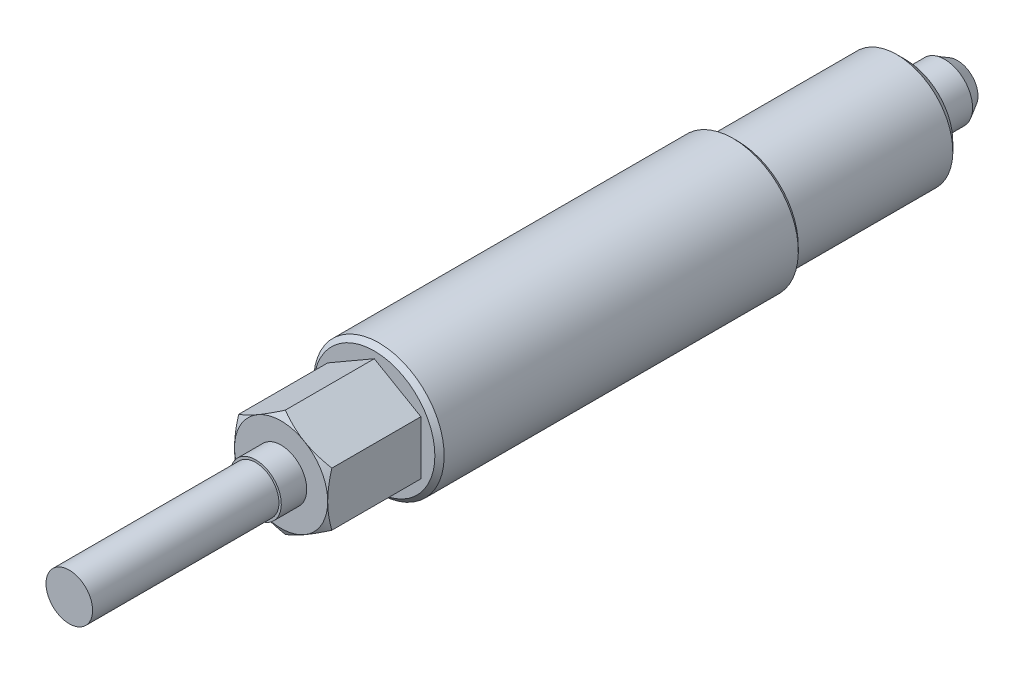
ISO-10303-21;
HEADER;
FILE_DESCRIPTION(('STEP AP214'),'2;1');
FILE_NAME('part.step','',(''),(''),'','','');
FILE_SCHEMA(('AUTOMOTIVE_DESIGN { 1 0 10303 214 1 1 1 1 }'));
ENDSEC;
DATA;
#1=APPLICATION_CONTEXT('core data for automotive mechanical design processes');
#2=APPLICATION_PROTOCOL_DEFINITION('international standard','automotive_design',2000,#1);
#3=PRODUCT_CONTEXT('',#1,'mechanical');
#4=PRODUCT('Part','Part','',(#3));
#5=PRODUCT_RELATED_PRODUCT_CATEGORY('part','',(#4));
#6=PRODUCT_DEFINITION_FORMATION('','',#4);
#7=PRODUCT_DEFINITION_CONTEXT('part definition',#1,'design');
#8=PRODUCT_DEFINITION('design','',#6,#7);
#9=PRODUCT_DEFINITION_SHAPE('','',#8);
#10=(LENGTH_UNIT() NAMED_UNIT(*) SI_UNIT(.MILLI.,.METRE.));
#11=(NAMED_UNIT(*) PLANE_ANGLE_UNIT() SI_UNIT($,.RADIAN.));
#12=(NAMED_UNIT(*) SI_UNIT($,.STERADIAN.) SOLID_ANGLE_UNIT());
#13=UNCERTAINTY_MEASURE_WITH_UNIT(LENGTH_MEASURE(1.E-05),#10,'distance_accuracy_value','');
#14=(GEOMETRIC_REPRESENTATION_CONTEXT(3) GLOBAL_UNCERTAINTY_ASSIGNED_CONTEXT((#13)) GLOBAL_UNIT_ASSIGNED_CONTEXT((#10,
#11,#12)) REPRESENTATION_CONTEXT('',''));
#15=CARTESIAN_POINT('',(0.,0.,0.));
#16=DIRECTION('',(0.,0.,1.));
#17=DIRECTION('',(1.,0.,0.));
#18=AXIS2_PLACEMENT_3D('',#15,#16,#17);
#19=CARTESIAN_POINT('',(0.,0.,57.));
#20=DIRECTION('',(0.,0.,-1.));
#21=DIRECTION('',(0.,1.,0.));
#22=AXIS2_PLACEMENT_3D('',#19,#20,#21);
#23=CONICAL_SURFACE('',#22,6.5,0.785398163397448);
#24=CARTESIAN_POINT('',(0.,0.,56.5));
#25=DIRECTION('',(0.,0.,-1.));
#26=DIRECTION('',(0.,1.,0.));
#27=AXIS2_PLACEMENT_3D('',#24,#25,#26);
#28=CIRCLE('',#27,7.);
#29=CARTESIAN_POINT('',(0.,7.,56.5));
#30=VERTEX_POINT('',#29);
#31=EDGE_CURVE('E151',#30,#30,#28,.T.);
#32=ORIENTED_EDGE('',*,*,#31,.F.);
#33=EDGE_LOOP('',(#32));
#34=FACE_BOUND('',#33,.T.);
#35=CARTESIAN_POINT('',(0.,0.,57.));
#36=DIRECTION('',(0.,0.,1.));
#37=DIRECTION('',(0.,-1.,0.));
#38=AXIS2_PLACEMENT_3D('',#35,#36,#37);
#39=CIRCLE('',#38,6.5);
#40=CARTESIAN_POINT('',(0.,-6.5,57.));
#41=VERTEX_POINT('',#40);
#42=EDGE_CURVE('E120',#41,#41,#39,.T.);
#43=ORIENTED_EDGE('',*,*,#42,.F.);
#44=EDGE_LOOP('',(#43));
#45=FACE_BOUND('',#44,.T.);
#46=ADVANCED_FACE('F14',(#34,#45),#23,.T.);
#47=CARTESIAN_POINT('',(0.,0.,0.));
#48=DIRECTION('',(0.,0.,-1.));
#49=DIRECTION('',(0.,1.,0.));
#50=AXIS2_PLACEMENT_3D('',#47,#48,#49);
#51=CYLINDRICAL_SURFACE('',#50,7.);
#52=CARTESIAN_POINT('',(0.,0.,18.5));
#53=DIRECTION('',(0.,0.,-1.));
#54=DIRECTION('',(0.,1.,0.));
#55=AXIS2_PLACEMENT_3D('',#52,#53,#54);
#56=CIRCLE('',#55,7.);
#57=CARTESIAN_POINT('',(0.,7.,18.5));
#58=VERTEX_POINT('',#57);
#59=EDGE_CURVE('E148',#58,#58,#56,.T.);
#60=ORIENTED_EDGE('',*,*,#59,.F.);
#61=EDGE_LOOP('',(#60));
#62=FACE_BOUND('',#61,.T.);
#63=ORIENTED_EDGE('',*,*,#31,.T.);
#64=EDGE_LOOP('',(#63));
#65=FACE_BOUND('',#64,.T.);
#66=ADVANCED_FACE('F218',(#62,#65),#51,.T.);
#67=CARTESIAN_POINT('',(0.,0.,18.5));
#68=DIRECTION('',(0.,0.,1.));
#69=DIRECTION('',(0.,-1.,0.));
#70=AXIS2_PLACEMENT_3D('',#67,#68,#69);
#71=CONICAL_SURFACE('',#70,7.,0.785398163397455);
#72=CARTESIAN_POINT('',(0.,0.,18.));
#73=DIRECTION('',(0.,0.,-1.));
#74=DIRECTION('',(0.,1.,0.));
#75=AXIS2_PLACEMENT_3D('',#72,#73,#74);
#76=CIRCLE('',#75,6.5);
#77=CARTESIAN_POINT('',(0.,6.5,18.));
#78=VERTEX_POINT('',#77);
#79=EDGE_CURVE('E145',#78,#78,#76,.T.);
#80=ORIENTED_EDGE('',*,*,#79,.F.);
#81=EDGE_LOOP('',(#80));
#82=FACE_BOUND('',#81,.T.);
#83=ORIENTED_EDGE('',*,*,#59,.T.);
#84=EDGE_LOOP('',(#83));
#85=FACE_BOUND('',#84,.T.);
#86=ADVANCED_FACE('F214',(#82,#85),#71,.T.);
#87=CARTESIAN_POINT('',(6.5,0.,18.));
#88=DIRECTION('',(0.,0.,1.));
#89=DIRECTION('',(0.,-1.,0.));
#90=AXIS2_PLACEMENT_3D('',#87,#88,#89);
#91=PLANE('',#90);
#92=CARTESIAN_POINT('',(0.,0.,18.));
#93=DIRECTION('',(0.,0.,-1.));
#94=DIRECTION('',(0.,1.,0.));
#95=AXIS2_PLACEMENT_3D('',#92,#93,#94);
#96=CIRCLE('',#95,6.);
#97=CARTESIAN_POINT('',(0.,6.,18.));
#98=VERTEX_POINT('',#97);
#99=EDGE_CURVE('E142',#98,#98,#96,.T.);
#100=ORIENTED_EDGE('',*,*,#99,.F.);
#101=EDGE_LOOP('',(#100));
#102=FACE_BOUND('',#101,.T.);
#103=ORIENTED_EDGE('',*,*,#79,.T.);
#104=EDGE_LOOP('',(#103));
#105=FACE_BOUND('',#104,.T.);
#106=ADVANCED_FACE('F211',(#102,#105),#91,.F.);
#107=CARTESIAN_POINT('',(-5.,2.88675134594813,57.));
#108=DIRECTION('',(-1.,0.,0.));
#109=DIRECTION('',(0.,-1.,0.));
#110=AXIS2_PLACEMENT_3D('',#107,#108,#109);
#111=PLANE('',#110);
#112=CARTESIAN_POINT('',(-5.,7.79521366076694,64.5399343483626));
#113=CARTESIAN_POINT('',(-5.,7.5764528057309,64.6462173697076));
#114=CARTESIAN_POINT('',(-5.,7.35719409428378,64.7514929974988));
#115=CARTESIAN_POINT('',(-5.,6.91741629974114,64.9594635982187));
#116=CARTESIAN_POINT('',(-5.,6.69689702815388,65.062158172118));
#117=CARTESIAN_POINT('',(-5.,6.25321722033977,65.2649085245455));
#118=CARTESIAN_POINT('',(-5.,6.03004886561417,65.3649472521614));
#119=CARTESIAN_POINT('',(-5.,5.58195110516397,65.5609843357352));
#120=CARTESIAN_POINT('',(-5.,5.35702178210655,65.6569828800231));
#121=CARTESIAN_POINT('',(-5.,4.89769068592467,65.8469148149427));
#122=CARTESIAN_POINT('',(-5.,4.66321876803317,65.9406794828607));
#123=CARTESIAN_POINT('',(-5.,4.19154711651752,66.1212112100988));
#124=CARTESIAN_POINT('',(-5.,3.95434708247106,66.2079774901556));
#125=CARTESIAN_POINT('',(-5.,3.47727241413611,66.3722652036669));
#126=CARTESIAN_POINT('',(-5.,3.23740416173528,66.4498049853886));
#127=CARTESIAN_POINT('',(-5.,2.75422725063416,66.593178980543));
#128=CARTESIAN_POINT('',(-5.,2.51091968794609,66.6590168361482));
#129=CARTESIAN_POINT('',(-5.,2.02205222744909,66.775510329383));
#130=CARTESIAN_POINT('',(-5.,1.77651220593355,66.8262478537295));
#131=CARTESIAN_POINT('',(-5.,1.2823365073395,66.9096903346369));
#132=CARTESIAN_POINT('',(-5.,1.03370114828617,66.9423971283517));
#133=CARTESIAN_POINT('',(-5.,0.537842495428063,66.9867425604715));
#134=CARTESIAN_POINT('',(-5.,0.290644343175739,66.9986553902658));
#135=CARTESIAN_POINT('',(-5.,-0.203882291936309,67.0011273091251));
#136=CARTESIAN_POINT('',(-5.,-0.451210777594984,66.9916859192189));
#137=CARTESIAN_POINT('',(-5.,-0.869833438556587,66.958305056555));
#138=CARTESIAN_POINT('',(-5.,-1.04157084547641,66.9395945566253));
#139=CARTESIAN_POINT('',(-5.,-1.38380826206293,66.8930197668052));
#140=CARTESIAN_POINT('',(-5.,-1.55430810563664,66.8651542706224));
#141=CARTESIAN_POINT('',(-5.,-2.06370854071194,66.7692878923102));
#142=CARTESIAN_POINT('',(-5.,-2.4003298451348,66.6890334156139));
#143=CARTESIAN_POINT('',(-5.,-2.9038384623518,66.5495919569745));
#144=CARTESIAN_POINT('',(-5.,-3.07332661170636,66.4992595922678));
#145=CARTESIAN_POINT('',(-5.,-3.41065642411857,66.3933023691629));
#146=CARTESIAN_POINT('',(-5.,-3.57849807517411,66.3376774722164));
#147=CARTESIAN_POINT('',(-5.,-3.91258846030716,66.2220333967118));
#148=CARTESIAN_POINT('',(-5.,-4.07883767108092,66.1620155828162));
#149=CARTESIAN_POINT('',(-5.,-4.40995264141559,66.0382984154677));
#150=CARTESIAN_POINT('',(-5.,-4.57481842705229,65.9745991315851));
#151=CARTESIAN_POINT('',(-5.,-5.00125658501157,65.8052374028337));
#152=CARTESIAN_POINT('',(-5.,-5.2618839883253,65.6971984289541));
#153=CARTESIAN_POINT('',(-5.,-5.78061537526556,65.4752037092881));
#154=CARTESIAN_POINT('',(-5.,-6.03871912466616,65.3612474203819));
#155=CARTESIAN_POINT('',(-5.,-6.55294218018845,65.1287585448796));
#156=CARTESIAN_POINT('',(-5.,-6.80906088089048,65.0102246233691));
#157=CARTESIAN_POINT('',(-5.,-7.3196320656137,64.7696140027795));
#158=CARTESIAN_POINT('',(-5.,-7.57408450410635,64.6475372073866));
#159=CARTESIAN_POINT('',(-5.,-8.08197779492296,64.4004152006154));
#160=CARTESIAN_POINT('',(-5.,-8.33541675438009,64.2753661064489));
#161=CARTESIAN_POINT('',(-5.,-8.84117201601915,64.0230156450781));
#162=CARTESIAN_POINT('',(-5.,-9.09348830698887,63.8957142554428));
#163=CARTESIAN_POINT('',(-5.,-9.84895753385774,63.5111422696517));
#164=CARTESIAN_POINT('',(-5.,-10.3507276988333,63.2511562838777));
#165=CARTESIAN_POINT('',(-5.,-11.3022827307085,62.752181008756));
#166=CARTESIAN_POINT('',(-5.,-11.7523102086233,62.5136522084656));
#167=CARTESIAN_POINT('',(-5.,-12.6508152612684,62.033639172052));
#168=CARTESIAN_POINT('',(-5.,-13.0992927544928,61.792154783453));
#169=CARTESIAN_POINT('',(-5.,-13.9936935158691,61.307716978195));
#170=CARTESIAN_POINT('',(-5.,-14.4396204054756,61.0647702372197));
#171=CARTESIAN_POINT('',(-5.,-15.3305024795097,60.5771741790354));
#172=CARTESIAN_POINT('',(-5.,-15.7754577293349,60.3325249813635));
#173=CARTESIAN_POINT('',(-5.,-16.2200666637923,60.0872519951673));
#174=B_SPLINE_CURVE_WITH_KNOTS('',3,(#112,#113,#114,#115,#116,#117,#118,#119,#120,#121,#122,
#123,#124,#125,#126,#127,#128,#129,#130,#131,#132,#133,#134,#135,#136,#137,#138,#139,#140,#141,
#142,#143,#144,#145,#146,#147,#148,#149,#150,#151,#152,#153,#154,#155,#156,#157,#158,#159,#160,
#161,#162,#163,#164,#165,#166,#167,#168,#169,#170,#171,#172,#173),.UNSPECIFIED.,.F.,.F.,(4,2,2,
2,2,2,2,2,2,2,2,2,2,2,2,2,2,2,2,2,2,2,2,2,2,2,2,2,2,2,4),(0.,0.729646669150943,1.45940545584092,
2.19306727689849,2.92669486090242,3.68418360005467,4.44175656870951,5.19779687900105,
5.95360146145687,6.70522945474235,7.45678085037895,8.19834515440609,8.93992609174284,
9.45793663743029,9.97601546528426,11.0127134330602,11.5430787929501,12.0734480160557,
12.6036531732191,13.1338483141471,13.9801413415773,14.8265121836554,15.6731317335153,
16.5197743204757,17.3675913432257,18.2154168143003,19.9107440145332,21.4387334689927,
22.9668020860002,24.4902367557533,26.0135655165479),.UNSPECIFIED.);
#175=CARTESIAN_POINT('',(-5.,-2.88675134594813,66.5534180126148));
#176=VERTEX_POINT('',#175);
#177=CARTESIAN_POINT('',(-5.,0.,67.));
#178=VERTEX_POINT('',#177);
#179=EDGE_CURVE('E9',#176,#178,#174,.F.);
#180=ORIENTED_EDGE('',*,*,#179,.T.);
#181=CARTESIAN_POINT('',(-5.,2.88675134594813,66.5534180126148));
#182=VERTEX_POINT('',#181);
#183=EDGE_CURVE('E18',#178,#182,#174,.F.);
#184=ORIENTED_EDGE('',*,*,#183,.T.);
#185=DIRECTION('',(0.,0.,1.));
#186=VECTOR('',#185,1.);
#187=CARTESIAN_POINT('',(-5.,2.88675134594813,57.));
#188=LINE('',#187,#186);
#189=CARTESIAN_POINT('',(-5.,2.88675134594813,57.));
#190=VERTEX_POINT('',#189);
#191=EDGE_CURVE('E111',#190,#182,#188,.T.);
#192=ORIENTED_EDGE('',*,*,#191,.F.);
#193=DIRECTION('',(0.,-1.,0.));
#194=VECTOR('',#193,1.);
#195=CARTESIAN_POINT('',(-5.,2.88675134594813,57.));
#196=LINE('',#195,#194);
#197=CARTESIAN_POINT('',(-5.,-2.88675134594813,57.));
#198=VERTEX_POINT('',#197);
#199=EDGE_CURVE('E97',#190,#198,#196,.T.);
#200=ORIENTED_EDGE('',*,*,#199,.T.);
#201=DIRECTION('',(0.,0.,1.));
#202=VECTOR('',#201,1.);
#203=CARTESIAN_POINT('',(-5.,-2.88675134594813,57.));
#204=LINE('',#203,#202);
#205=EDGE_CURVE('E89',#198,#176,#204,.T.);
#206=ORIENTED_EDGE('',*,*,#205,.T.);
#207=EDGE_LOOP('',(#180,#184,#192,#200,#206));
#208=FACE_BOUND('',#207,.T.);
#209=ADVANCED_FACE('F110',(#208),#111,.T.);
#210=CARTESIAN_POINT('',(0.,5.77350269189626,57.));
#211=DIRECTION('',(-0.5,0.866025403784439,0.));
#212=DIRECTION('',(-0.866025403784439,-0.5,0.));
#213=AXIS2_PLACEMENT_3D('',#210,#211,#212);
#214=PLANE('',#213);
#215=CARTESIAN_POINT('',(-5.0002,2.88663587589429,66.5533513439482));
#216=CARTESIAN_POINT('',(-4.78046540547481,3.01349970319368,66.6266134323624));
#217=CARTESIAN_POINT('',(-4.55885141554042,3.14144859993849,66.6932486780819));
#218=CARTESIAN_POINT('',(-4.11178600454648,3.39956193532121,66.8095610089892));
#219=CARTESIAN_POINT('',(-3.88632664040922,3.52973095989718,66.8591969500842));
#220=CARTESIAN_POINT('',(-3.43816769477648,3.78847564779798,66.9364489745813));
#221=CARTESIAN_POINT('',(-3.2155379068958,3.91701101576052,66.9645796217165));
#222=CARTESIAN_POINT('',(-2.88081009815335,4.11026620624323,66.9898050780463));
#223=CARTESIAN_POINT('',(-2.76915780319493,4.17472868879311,66.9953865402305));
#224=CARTESIAN_POINT('',(-2.5457500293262,4.30371322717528,67.0007977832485));
#225=CARTESIAN_POINT('',(-2.43399455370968,4.36823528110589,67.0006277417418));
#226=CARTESIAN_POINT('',(-2.12781576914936,4.54500768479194,66.992246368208));
#227=CARTESIAN_POINT('',(-1.93349391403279,4.65719946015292,66.9781702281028));
#228=CARTESIAN_POINT('',(-1.5461398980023,4.88083840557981,66.9335347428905));
#229=CARTESIAN_POINT('',(-1.35310909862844,4.9922847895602,66.9029601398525));
#230=CARTESIAN_POINT('',(-0.964974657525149,5.21637431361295,66.8265315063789));
#231=CARTESIAN_POINT('',(-0.769920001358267,5.32898917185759,66.7803536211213));
#232=CARTESIAN_POINT('',(-0.382719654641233,5.55253939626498,66.6755482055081));
#233=CARTESIAN_POINT('',(-0.190569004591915,5.66347762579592,66.6169452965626));
#234=CARTESIAN_POINT('',(0.000200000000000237,5.7736181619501,66.5533513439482));
#235=B_SPLINE_CURVE_WITH_KNOTS('',3,(#215,#216,#217,#218,#219,#220,#221,#222,#223,#224,#225,
#226,#227,#228,#229,#230,#231,#232,#233,#234),.UNSPECIFIED.,.F.,.F.,(4,2,2,2,2,2,2,2,2,4),(0.,
0.792555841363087,1.58701660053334,2.36181537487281,2.74884076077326,3.13585419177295,
3.80962362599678,4.48401723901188,5.17336882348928,5.86136694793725),.UNSPECIFIED.);
#236=CARTESIAN_POINT('',(-2.5,4.3301270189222,67.));
#237=VERTEX_POINT('',#236);
#238=EDGE_CURVE('E255',#182,#237,#235,.T.);
#239=ORIENTED_EDGE('',*,*,#238,.T.);
#240=CARTESIAN_POINT('',(0.,5.77350269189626,66.5534180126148));
#241=VERTEX_POINT('',#240);
#242=EDGE_CURVE('E249',#237,#241,#235,.T.);
#243=ORIENTED_EDGE('',*,*,#242,.T.);
#244=DIRECTION('',(0.,0.,1.));
#245=VECTOR('',#244,1.);
#246=CARTESIAN_POINT('',(0.,5.77350269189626,57.));
#247=LINE('',#246,#245);
#248=CARTESIAN_POINT('',(0.,5.77350269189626,57.));
#249=VERTEX_POINT('',#248);
#250=EDGE_CURVE('E121',#249,#241,#247,.T.);
#251=ORIENTED_EDGE('',*,*,#250,.F.);
#252=DIRECTION('',(-0.866025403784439,-0.5,0.));
#253=VECTOR('',#252,1.);
#254=CARTESIAN_POINT('',(0.,5.77350269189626,57.));
#255=LINE('',#254,#253);
#256=EDGE_CURVE('E113',#249,#190,#255,.T.);
#257=ORIENTED_EDGE('',*,*,#256,.T.);
#258=ORIENTED_EDGE('',*,*,#191,.T.);
#259=EDGE_LOOP('',(#239,#243,#251,#257,#258));
#260=FACE_BOUND('',#259,.T.);
#261=ADVANCED_FACE('F242',(#260),#214,.T.);
#262=CARTESIAN_POINT('',(5.,2.88675134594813,57.));
#263=DIRECTION('',(0.5,0.866025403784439,0.));
#264=DIRECTION('',(-0.866025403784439,0.5,0.));
#265=AXIS2_PLACEMENT_3D('',#262,#263,#264);
#266=PLANE('',#265);
#267=CARTESIAN_POINT('',(-0.0002,5.77361816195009,66.5533513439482));
#268=CARTESIAN_POINT('',(0.219534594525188,5.6467543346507,66.6266134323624));
#269=CARTESIAN_POINT('',(0.441148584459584,5.51880543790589,66.6932486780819));
#270=CARTESIAN_POINT('',(0.888213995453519,5.26069210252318,66.8095610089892));
#271=CARTESIAN_POINT('',(1.11367335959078,5.13052307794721,66.8591969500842));
#272=CARTESIAN_POINT('',(1.56183230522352,4.87177839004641,66.9364489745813));
#273=CARTESIAN_POINT('',(1.7844620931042,4.74324302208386,66.9645796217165));
#274=CARTESIAN_POINT('',(2.11918990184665,4.54998783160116,66.9898050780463));
#275=CARTESIAN_POINT('',(2.23084219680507,4.48552534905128,66.9953865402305));
#276=CARTESIAN_POINT('',(2.4542499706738,4.35654081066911,67.0007977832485));
#277=CARTESIAN_POINT('',(2.56600544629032,4.2920187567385,67.0006277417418));
#278=CARTESIAN_POINT('',(2.87218423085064,4.11524635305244,66.992246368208));
#279=CARTESIAN_POINT('',(3.06650608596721,4.00305457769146,66.9781702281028));
#280=CARTESIAN_POINT('',(3.4538601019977,3.77941563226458,66.9335347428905));
#281=CARTESIAN_POINT('',(3.64689090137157,3.66796924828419,66.9029601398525));
#282=CARTESIAN_POINT('',(4.03502534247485,3.44387972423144,66.8265315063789));
#283=CARTESIAN_POINT('',(4.23007999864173,3.3312648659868,66.7803536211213));
#284=CARTESIAN_POINT('',(4.61728034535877,3.10771464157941,66.6755482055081));
#285=CARTESIAN_POINT('',(4.80943099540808,2.99677641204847,66.6169452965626));
#286=CARTESIAN_POINT('',(5.0002,2.88663587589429,66.5533513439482));
#287=B_SPLINE_CURVE_WITH_KNOTS('',3,(#267,#268,#269,#270,#271,#272,#273,#274,#275,#276,#277,
#278,#279,#280,#281,#282,#283,#284,#285,#286),.UNSPECIFIED.,.F.,.F.,(4,2,2,2,2,2,2,2,2,4),(0.,
0.792555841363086,1.58701660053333,2.3618153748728,2.74884076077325,3.13585419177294,
3.80962362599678,4.48401723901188,5.17336882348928,5.86136694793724),.UNSPECIFIED.);
#288=CARTESIAN_POINT('',(2.5,4.3301270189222,67.));
#289=VERTEX_POINT('',#288);
#290=EDGE_CURVE('E256',#241,#289,#287,.T.);
#291=ORIENTED_EDGE('',*,*,#290,.T.);
#292=CARTESIAN_POINT('',(5.,2.88675134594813,66.5534180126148));
#293=VERTEX_POINT('',#292);
#294=EDGE_CURVE('E257',#289,#293,#287,.T.);
#295=ORIENTED_EDGE('',*,*,#294,.T.);
#296=DIRECTION('',(0.,0.,1.));
#297=VECTOR('',#296,1.);
#298=CARTESIAN_POINT('',(5.,2.88675134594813,57.));
#299=LINE('',#298,#297);
#300=CARTESIAN_POINT('',(5.,2.88675134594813,57.));
#301=VERTEX_POINT('',#300);
#302=EDGE_CURVE('E124',#301,#293,#299,.T.);
#303=ORIENTED_EDGE('',*,*,#302,.F.);
#304=DIRECTION('',(-0.866025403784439,0.5,0.));
#305=VECTOR('',#304,1.);
#306=CARTESIAN_POINT('',(5.,2.88675134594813,57.));
#307=LINE('',#306,#305);
#308=EDGE_CURVE('E115',#301,#249,#307,.T.);
#309=ORIENTED_EDGE('',*,*,#308,.T.);
#310=ORIENTED_EDGE('',*,*,#250,.T.);
#311=EDGE_LOOP('',(#291,#295,#303,#309,#310));
#312=FACE_BOUND('',#311,.T.);
#313=ADVANCED_FACE('F246',(#312),#266,.T.);
#314=CARTESIAN_POINT('',(5.,-2.88675134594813,57.));
#315=DIRECTION('',(1.,0.,0.));
#316=DIRECTION('',(0.,1.,0.));
#317=AXIS2_PLACEMENT_3D('',#314,#315,#316);
#318=PLANE('',#317);
#319=CARTESIAN_POINT('',(5.,7.79521366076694,64.5399343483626));
#320=CARTESIAN_POINT('',(5.,7.5764528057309,64.6462173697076));
#321=CARTESIAN_POINT('',(5.,7.35719409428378,64.7514929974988));
#322=CARTESIAN_POINT('',(5.,6.91741629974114,64.9594635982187));
#323=CARTESIAN_POINT('',(5.,6.69689702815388,65.062158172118));
#324=CARTESIAN_POINT('',(5.,6.25321722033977,65.2649085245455));
#325=CARTESIAN_POINT('',(5.,6.03004886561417,65.3649472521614));
#326=CARTESIAN_POINT('',(5.,5.58195110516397,65.5609843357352));
#327=CARTESIAN_POINT('',(5.,5.35702178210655,65.6569828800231));
#328=CARTESIAN_POINT('',(5.,4.89769068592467,65.8469148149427));
#329=CARTESIAN_POINT('',(5.,4.66321876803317,65.9406794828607));
#330=CARTESIAN_POINT('',(5.,4.19154711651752,66.1212112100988));
#331=CARTESIAN_POINT('',(5.,3.95434708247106,66.2079774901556));
#332=CARTESIAN_POINT('',(5.,3.47727241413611,66.3722652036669));
#333=CARTESIAN_POINT('',(5.,3.23740416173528,66.4498049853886));
#334=CARTESIAN_POINT('',(5.,2.75422725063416,66.593178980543));
#335=CARTESIAN_POINT('',(5.,2.51091968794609,66.6590168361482));
#336=CARTESIAN_POINT('',(5.,2.02205222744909,66.775510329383));
#337=CARTESIAN_POINT('',(5.,1.77651220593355,66.8262478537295));
#338=CARTESIAN_POINT('',(5.,1.2823365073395,66.9096903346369));
#339=CARTESIAN_POINT('',(5.,1.03370114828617,66.9423971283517));
#340=CARTESIAN_POINT('',(5.,0.537842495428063,66.9867425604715));
#341=CARTESIAN_POINT('',(5.,0.290644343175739,66.9986553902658));
#342=CARTESIAN_POINT('',(5.,-0.203882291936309,67.0011273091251));
#343=CARTESIAN_POINT('',(5.,-0.451210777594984,66.9916859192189));
#344=CARTESIAN_POINT('',(5.,-0.869833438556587,66.958305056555));
#345=CARTESIAN_POINT('',(5.,-1.04157084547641,66.9395945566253));
#346=CARTESIAN_POINT('',(5.,-1.38380826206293,66.8930197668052));
#347=CARTESIAN_POINT('',(5.,-1.55430810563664,66.8651542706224));
#348=CARTESIAN_POINT('',(5.,-2.06370854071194,66.7692878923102));
#349=CARTESIAN_POINT('',(5.,-2.4003298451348,66.6890334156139));
#350=CARTESIAN_POINT('',(5.,-2.9038384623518,66.5495919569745));
#351=CARTESIAN_POINT('',(5.,-3.07332661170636,66.4992595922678));
#352=CARTESIAN_POINT('',(5.,-3.41065642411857,66.3933023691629));
#353=CARTESIAN_POINT('',(5.,-3.57849807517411,66.3376774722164));
#354=CARTESIAN_POINT('',(5.,-3.91258846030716,66.2220333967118));
#355=CARTESIAN_POINT('',(5.,-4.07883767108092,66.1620155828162));
#356=CARTESIAN_POINT('',(5.,-4.40995264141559,66.0382984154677));
#357=CARTESIAN_POINT('',(5.,-4.57481842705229,65.9745991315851));
#358=CARTESIAN_POINT('',(5.,-5.00125658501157,65.8052374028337));
#359=CARTESIAN_POINT('',(5.,-5.2618839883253,65.6971984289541));
#360=CARTESIAN_POINT('',(5.,-5.78061537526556,65.4752037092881));
#361=CARTESIAN_POINT('',(5.,-6.03871912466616,65.3612474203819));
#362=CARTESIAN_POINT('',(5.,-6.55294218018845,65.1287585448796));
#363=CARTESIAN_POINT('',(5.,-6.80906088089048,65.0102246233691));
#364=CARTESIAN_POINT('',(5.,-7.3196320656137,64.7696140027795));
#365=CARTESIAN_POINT('',(5.,-7.57408450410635,64.6475372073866));
#366=CARTESIAN_POINT('',(5.,-8.08197779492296,64.4004152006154));
#367=CARTESIAN_POINT('',(5.,-8.33541675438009,64.2753661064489));
#368=CARTESIAN_POINT('',(5.,-8.84117201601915,64.0230156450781));
#369=CARTESIAN_POINT('',(5.,-9.09348830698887,63.8957142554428));
#370=CARTESIAN_POINT('',(5.,-9.84895753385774,63.5111422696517));
#371=CARTESIAN_POINT('',(5.,-10.3507276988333,63.2511562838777));
#372=CARTESIAN_POINT('',(5.,-11.3022827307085,62.752181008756));
#373=CARTESIAN_POINT('',(5.,-11.7523102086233,62.5136522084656));
#374=CARTESIAN_POINT('',(5.,-12.6508152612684,62.033639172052));
#375=CARTESIAN_POINT('',(5.,-13.0992927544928,61.792154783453));
#376=CARTESIAN_POINT('',(5.,-13.9936935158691,61.307716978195));
#377=CARTESIAN_POINT('',(5.,-14.4396204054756,61.0647702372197));
#378=CARTESIAN_POINT('',(5.,-15.3305024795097,60.5771741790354));
#379=CARTESIAN_POINT('',(5.,-15.7754577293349,60.3325249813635));
#380=CARTESIAN_POINT('',(5.,-16.2200666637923,60.0872519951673));
#381=B_SPLINE_CURVE_WITH_KNOTS('',3,(#319,#320,#321,#322,#323,#324,#325,#326,#327,#328,#329,
#330,#331,#332,#333,#334,#335,#336,#337,#338,#339,#340,#341,#342,#343,#344,#345,#346,#347,#348,
#349,#350,#351,#352,#353,#354,#355,#356,#357,#358,#359,#360,#361,#362,#363,#364,#365,#366,#367,
#368,#369,#370,#371,#372,#373,#374,#375,#376,#377,#378,#379,#380),.UNSPECIFIED.,.F.,.F.,(4,2,2,
2,2,2,2,2,2,2,2,2,2,2,2,2,2,2,2,2,2,2,2,2,2,2,2,2,2,2,4),(0.,0.729646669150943,1.45940545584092,
2.19306727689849,2.92669486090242,3.68418360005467,4.44175656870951,5.19779687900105,
5.95360146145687,6.70522945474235,7.45678085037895,8.19834515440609,8.93992609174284,
9.45793663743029,9.97601546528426,11.0127134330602,11.5430787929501,12.0734480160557,
12.6036531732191,13.1338483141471,13.9801413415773,14.8265121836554,15.6731317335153,
16.5197743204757,17.3675913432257,18.2154168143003,19.9107440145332,21.4387334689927,
22.9668020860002,24.4902367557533,26.0135655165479),.UNSPECIFIED.);
#382=CARTESIAN_POINT('',(5.,0.,67.));
#383=VERTEX_POINT('',#382);
#384=EDGE_CURVE('E262',#293,#383,#381,.T.);
#385=ORIENTED_EDGE('',*,*,#384,.T.);
#386=CARTESIAN_POINT('',(5.,-2.88675134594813,66.5534180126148));
#387=VERTEX_POINT('',#386);
#388=EDGE_CURVE('E263',#383,#387,#381,.T.);
#389=ORIENTED_EDGE('',*,*,#388,.T.);
#390=DIRECTION('',(0.,0.,1.));
#391=VECTOR('',#390,1.);
#392=CARTESIAN_POINT('',(5.,-2.88675134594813,57.));
#393=LINE('',#392,#391);
#394=CARTESIAN_POINT('',(5.,-2.88675134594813,57.));
#395=VERTEX_POINT('',#394);
#396=EDGE_CURVE('E127',#395,#387,#393,.T.);
#397=ORIENTED_EDGE('',*,*,#396,.F.);
#398=DIRECTION('',(0.,1.,0.));
#399=VECTOR('',#398,1.);
#400=CARTESIAN_POINT('',(5.,-2.88675134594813,57.));
#401=LINE('',#400,#399);
#402=EDGE_CURVE('E316',#395,#301,#401,.T.);
#403=ORIENTED_EDGE('',*,*,#402,.T.);
#404=ORIENTED_EDGE('',*,*,#302,.T.);
#405=EDGE_LOOP('',(#385,#389,#397,#403,#404));
#406=FACE_BOUND('',#405,.T.);
#407=ADVANCED_FACE('F269',(#406),#318,.T.);
#408=CARTESIAN_POINT('',(0.,-5.77350269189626,57.));
#409=DIRECTION('',(0.5,-0.866025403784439,0.));
#410=DIRECTION('',(0.866025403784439,0.5,0.));
#411=AXIS2_PLACEMENT_3D('',#408,#409,#410);
#412=PLANE('',#411);
#413=CARTESIAN_POINT('',(5.0002,-2.88663587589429,66.5533513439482));
#414=CARTESIAN_POINT('',(4.78046540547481,-3.01349970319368,66.6266134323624));
#415=CARTESIAN_POINT('',(4.55885141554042,-3.14144859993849,66.6932486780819));
#416=CARTESIAN_POINT('',(4.11178600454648,-3.39956193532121,66.8095610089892));
#417=CARTESIAN_POINT('',(3.88632664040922,-3.52973095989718,66.8591969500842));
#418=CARTESIAN_POINT('',(3.43816769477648,-3.78847564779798,66.9364489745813));
#419=CARTESIAN_POINT('',(3.2155379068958,-3.91701101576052,66.9645796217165));
#420=CARTESIAN_POINT('',(2.88081009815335,-4.11026620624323,66.9898050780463));
#421=CARTESIAN_POINT('',(2.76915780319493,-4.17472868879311,66.9953865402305));
#422=CARTESIAN_POINT('',(2.5457500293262,-4.30371322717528,67.0007977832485));
#423=CARTESIAN_POINT('',(2.43399455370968,-4.36823528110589,67.0006277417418));
#424=CARTESIAN_POINT('',(2.12781576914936,-4.54500768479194,66.992246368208));
#425=CARTESIAN_POINT('',(1.93349391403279,-4.65719946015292,66.9781702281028));
#426=CARTESIAN_POINT('',(1.5461398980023,-4.88083840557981,66.9335347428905));
#427=CARTESIAN_POINT('',(1.35310909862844,-4.9922847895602,66.9029601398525));
#428=CARTESIAN_POINT('',(0.964974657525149,-5.21637431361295,66.8265315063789));
#429=CARTESIAN_POINT('',(0.769920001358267,-5.32898917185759,66.7803536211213));
#430=CARTESIAN_POINT('',(0.382719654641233,-5.55253939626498,66.6755482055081));
#431=CARTESIAN_POINT('',(0.190569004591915,-5.66347762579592,66.6169452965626));
#432=CARTESIAN_POINT('',(-0.000200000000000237,-5.7736181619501,66.5533513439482));
#433=B_SPLINE_CURVE_WITH_KNOTS('',3,(#413,#414,#415,#416,#417,#418,#419,#420,#421,#422,#423,
#424,#425,#426,#427,#428,#429,#430,#431,#432),.UNSPECIFIED.,.F.,.F.,(4,2,2,2,2,2,2,2,2,4),(0.,
0.792555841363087,1.58701660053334,2.36181537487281,2.74884076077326,3.13585419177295,
3.80962362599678,4.48401723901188,5.17336882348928,5.86136694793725),.UNSPECIFIED.);
#434=CARTESIAN_POINT('',(2.5,-4.3301270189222,67.));
#435=VERTEX_POINT('',#434);
#436=EDGE_CURVE('E268',#387,#435,#433,.T.);
#437=ORIENTED_EDGE('',*,*,#436,.T.);
#438=CARTESIAN_POINT('',(0.,-5.77350269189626,66.5534180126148));
#439=VERTEX_POINT('',#438);
#440=EDGE_CURVE('E177',#435,#439,#433,.T.);
#441=ORIENTED_EDGE('',*,*,#440,.T.);
#442=DIRECTION('',(0.,0.,1.));
#443=VECTOR('',#442,1.);
#444=CARTESIAN_POINT('',(0.,-5.77350269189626,57.));
#445=LINE('',#444,#443);
#446=CARTESIAN_POINT('',(0.,-5.77350269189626,57.));
#447=VERTEX_POINT('',#446);
#448=EDGE_CURVE('E96',#447,#439,#445,.T.);
#449=ORIENTED_EDGE('',*,*,#448,.F.);
#450=DIRECTION('',(0.866025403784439,0.5,0.));
#451=VECTOR('',#450,1.);
#452=CARTESIAN_POINT('',(0.,-5.77350269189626,57.));
#453=LINE('',#452,#451);
#454=EDGE_CURVE('E107',#447,#395,#453,.T.);
#455=ORIENTED_EDGE('',*,*,#454,.T.);
#456=ORIENTED_EDGE('',*,*,#396,.T.);
#457=EDGE_LOOP('',(#437,#441,#449,#455,#456));
#458=FACE_BOUND('',#457,.T.);
#459=ADVANCED_FACE('F191',(#458),#412,.T.);
#460=CARTESIAN_POINT('',(-5.,-2.88675134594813,57.));
#461=DIRECTION('',(-0.5,-0.866025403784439,0.));
#462=DIRECTION('',(0.866025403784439,-0.5,0.));
#463=AXIS2_PLACEMENT_3D('',#460,#461,#462);
#464=PLANE('',#463);
#465=CARTESIAN_POINT('',(0.0002,-5.77361816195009,66.5533513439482));
#466=CARTESIAN_POINT('',(-0.219534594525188,-5.6467543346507,66.6266134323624));
#467=CARTESIAN_POINT('',(-0.441148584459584,-5.51880543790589,66.6932486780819));
#468=CARTESIAN_POINT('',(-0.888213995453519,-5.26069210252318,66.8095610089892));
#469=CARTESIAN_POINT('',(-1.11367335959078,-5.13052307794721,66.8591969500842));
#470=CARTESIAN_POINT('',(-1.56183230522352,-4.87177839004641,66.9364489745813));
#471=CARTESIAN_POINT('',(-1.7844620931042,-4.74324302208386,66.9645796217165));
#472=CARTESIAN_POINT('',(-2.11918990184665,-4.54998783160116,66.9898050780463));
#473=CARTESIAN_POINT('',(-2.23084219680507,-4.48552534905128,66.9953865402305));
#474=CARTESIAN_POINT('',(-2.4542499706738,-4.35654081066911,67.0007977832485));
#475=CARTESIAN_POINT('',(-2.56600544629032,-4.2920187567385,67.0006277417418));
#476=CARTESIAN_POINT('',(-2.87218423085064,-4.11524635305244,66.992246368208));
#477=CARTESIAN_POINT('',(-3.06650608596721,-4.00305457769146,66.9781702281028));
#478=CARTESIAN_POINT('',(-3.4538601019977,-3.77941563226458,66.9335347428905));
#479=CARTESIAN_POINT('',(-3.64689090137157,-3.66796924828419,66.9029601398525));
#480=CARTESIAN_POINT('',(-4.03502534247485,-3.44387972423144,66.8265315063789));
#481=CARTESIAN_POINT('',(-4.23007999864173,-3.3312648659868,66.7803536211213));
#482=CARTESIAN_POINT('',(-4.61728034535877,-3.10771464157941,66.6755482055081));
#483=CARTESIAN_POINT('',(-4.80943099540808,-2.99677641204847,66.6169452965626));
#484=CARTESIAN_POINT('',(-5.0002,-2.88663587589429,66.5533513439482));
#485=B_SPLINE_CURVE_WITH_KNOTS('',3,(#465,#466,#467,#468,#469,#470,#471,#472,#473,#474,#475,
#476,#477,#478,#479,#480,#481,#482,#483,#484),.UNSPECIFIED.,.F.,.F.,(4,2,2,2,2,2,2,2,2,4),(0.,
0.792555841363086,1.58701660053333,2.3618153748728,2.74884076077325,3.13585419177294,
3.80962362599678,4.48401723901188,5.17336882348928,5.86136694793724),.UNSPECIFIED.);
#486=CARTESIAN_POINT('',(-2.5,-4.3301270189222,67.));
#487=VERTEX_POINT('',#486);
#488=EDGE_CURVE('E35',#439,#487,#485,.T.);
#489=ORIENTED_EDGE('',*,*,#488,.T.);
#490=EDGE_CURVE('E93',#487,#176,#485,.T.);
#491=ORIENTED_EDGE('',*,*,#490,.T.);
#492=ORIENTED_EDGE('',*,*,#205,.F.);
#493=DIRECTION('',(0.866025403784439,-0.5,0.));
#494=VECTOR('',#493,1.);
#495=CARTESIAN_POINT('',(-5.,-2.88675134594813,57.));
#496=LINE('',#495,#494);
#497=EDGE_CURVE('E92',#198,#447,#496,.T.);
#498=ORIENTED_EDGE('',*,*,#497,.T.);
#499=ORIENTED_EDGE('',*,*,#448,.T.);
#500=EDGE_LOOP('',(#489,#491,#492,#498,#499));
#501=FACE_BOUND('',#500,.T.);
#502=ADVANCED_FACE('F91',(#501),#464,.T.);
#503=CARTESIAN_POINT('',(0.,0.,57.));
#504=DIRECTION('',(0.,0.,1.));
#505=DIRECTION('',(0.,-1.,0.));
#506=AXIS2_PLACEMENT_3D('',#503,#504,#505);
#507=PLANE('',#506);
#508=ORIENTED_EDGE('',*,*,#199,.F.);
#509=ORIENTED_EDGE('',*,*,#256,.F.);
#510=ORIENTED_EDGE('',*,*,#308,.F.);
#511=ORIENTED_EDGE('',*,*,#402,.F.);
#512=ORIENTED_EDGE('',*,*,#454,.F.);
#513=ORIENTED_EDGE('',*,*,#497,.F.);
#514=EDGE_LOOP('',(#508,#509,#510,#511,#512,#513));
#515=FACE_BOUND('',#514,.T.);
#516=ORIENTED_EDGE('',*,*,#42,.T.);
#517=EDGE_LOOP('',(#516));
#518=FACE_BOUND('',#517,.T.);
#519=ADVANCED_FACE('F102',(#515,#518),#507,.T.);
#520=CARTESIAN_POINT('',(0.,0.,89.73));
#521=DIRECTION('',(0.,0.,-1.));
#522=DIRECTION('',(0.,1.,0.));
#523=AXIS2_PLACEMENT_3D('',#520,#521,#522);
#524=PLANE('',#523);
#525=CARTESIAN_POINT('',(0.,0.,89.73));
#526=DIRECTION('',(0.,0.,-1.));
#527=DIRECTION('',(0.,1.,0.));
#528=AXIS2_PLACEMENT_3D('',#525,#526,#527);
#529=CIRCLE('',#528,2.5);
#530=CARTESIAN_POINT('',(0.,2.5,89.73));
#531=VERTEX_POINT('',#530);
#532=EDGE_CURVE('E168',#531,#531,#529,.T.);
#533=ORIENTED_EDGE('',*,*,#532,.F.);
#534=EDGE_LOOP('',(#533));
#535=FACE_BOUND('',#534,.T.);
#536=ADVANCED_FACE('F16',(#535),#524,.F.);
#537=CARTESIAN_POINT('',(0.,0.,0.));
#538=DIRECTION('',(0.,0.,-1.));
#539=DIRECTION('',(0.,1.,0.));
#540=AXIS2_PLACEMENT_3D('',#537,#538,#539);
#541=CYLINDRICAL_SURFACE('',#540,2.5);
#542=CARTESIAN_POINT('',(0.,0.,69.73));
#543=DIRECTION('',(0.,0.,-1.));
#544=DIRECTION('',(0.,1.,0.));
#545=AXIS2_PLACEMENT_3D('',#542,#543,#544);
#546=CIRCLE('',#545,2.5);
#547=CARTESIAN_POINT('',(0.,2.5,69.73));
#548=VERTEX_POINT('',#547);
#549=EDGE_CURVE('E165',#548,#548,#546,.T.);
#550=ORIENTED_EDGE('',*,*,#549,.F.);
#551=EDGE_LOOP('',(#550));
#552=FACE_BOUND('',#551,.T.);
#553=ORIENTED_EDGE('',*,*,#532,.T.);
#554=EDGE_LOOP('',(#553));
#555=FACE_BOUND('',#554,.T.);
#556=ADVANCED_FACE('F235',(#552,#555),#541,.T.);
#557=CARTESIAN_POINT('',(2.5,0.,69.73));
#558=DIRECTION('',(0.,0.,-1.));
#559=DIRECTION('',(0.,1.,0.));
#560=AXIS2_PLACEMENT_3D('',#557,#558,#559);
#561=PLANE('',#560);
#562=CARTESIAN_POINT('',(0.,0.,69.73));
#563=DIRECTION('',(0.,0.,-1.));
#564=DIRECTION('',(0.,1.,0.));
#565=AXIS2_PLACEMENT_3D('',#562,#563,#564);
#566=CIRCLE('',#565,2.75);
#567=CARTESIAN_POINT('',(0.,2.75,69.73));
#568=VERTEX_POINT('',#567);
#569=EDGE_CURVE('E162',#568,#568,#566,.T.);
#570=ORIENTED_EDGE('',*,*,#569,.F.);
#571=EDGE_LOOP('',(#570));
#572=FACE_BOUND('',#571,.T.);
#573=ORIENTED_EDGE('',*,*,#549,.T.);
#574=EDGE_LOOP('',(#573));
#575=FACE_BOUND('',#574,.T.);
#576=ADVANCED_FACE('F574',(#572,#575),#561,.F.);
#577=CARTESIAN_POINT('',(0.,0.,0.));
#578=DIRECTION('',(0.,0.,-1.));
#579=DIRECTION('',(0.,1.,0.));
#580=AXIS2_PLACEMENT_3D('',#577,#578,#579);
#581=CYLINDRICAL_SURFACE('',#580,2.75);
#582=CARTESIAN_POINT('',(0.,0.,67.));
#583=DIRECTION('',(0.,0.,-1.));
#584=DIRECTION('',(0.,1.,0.));
#585=AXIS2_PLACEMENT_3D('',#582,#583,#584);
#586=CIRCLE('',#585,2.75);
#587=CARTESIAN_POINT('',(0.,2.75,67.));
#588=VERTEX_POINT('',#587);
#589=EDGE_CURVE('E158',#588,#588,#586,.T.);
#590=ORIENTED_EDGE('',*,*,#589,.F.);
#591=EDGE_LOOP('',(#590));
#592=FACE_BOUND('',#591,.T.);
#593=ORIENTED_EDGE('',*,*,#569,.T.);
#594=EDGE_LOOP('',(#593));
#595=FACE_BOUND('',#594,.T.);
#596=ADVANCED_FACE('F567',(#592,#595),#581,.T.);
#597=CARTESIAN_POINT('',(0.,0.,67.));
#598=DIRECTION('',(0.,0.,-1.));
#599=DIRECTION('',(0.,1.,0.));
#600=AXIS2_PLACEMENT_3D('',#597,#598,#599);
#601=CONICAL_SURFACE('',#600,5.,1.0471975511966);
#602=ORIENTED_EDGE('',*,*,#388,.F.);
#603=CARTESIAN_POINT('',(0.,0.,67.));
#604=DIRECTION('',(0.,0.,-1.));
#605=DIRECTION('',(0.,1.,0.));
#606=AXIS2_PLACEMENT_3D('',#603,#604,#605);
#607=CIRCLE('',#606,5.);
#608=EDGE_CURVE('E155',#383,#435,#607,.T.);
#609=ORIENTED_EDGE('',*,*,#608,.T.);
#610=ORIENTED_EDGE('',*,*,#436,.F.);
#611=EDGE_LOOP('',(#602,#609,#610));
#612=FACE_BOUND('',#611,.T.);
#613=ADVANCED_FACE('F287',(#612),#601,.T.);
#614=ORIENTED_EDGE('',*,*,#440,.F.);
#615=EDGE_CURVE('E159',#435,#487,#607,.T.);
#616=ORIENTED_EDGE('',*,*,#615,.T.);
#617=ORIENTED_EDGE('',*,*,#488,.F.);
#618=EDGE_LOOP('',(#614,#616,#617));
#619=FACE_BOUND('',#618,.T.);
#620=ADVANCED_FACE('F530',(#619),#601,.T.);
#621=ORIENTED_EDGE('',*,*,#183,.F.);
#622=EDGE_CURVE('E305',#178,#237,#607,.T.);
#623=ORIENTED_EDGE('',*,*,#622,.T.);
#624=ORIENTED_EDGE('',*,*,#238,.F.);
#625=EDGE_LOOP('',(#621,#623,#624));
#626=FACE_BOUND('',#625,.T.);
#627=ADVANCED_FACE('F529',(#626),#601,.T.);
#628=ORIENTED_EDGE('',*,*,#242,.F.);
#629=EDGE_CURVE('E294',#237,#289,#607,.T.);
#630=ORIENTED_EDGE('',*,*,#629,.T.);
#631=ORIENTED_EDGE('',*,*,#290,.F.);
#632=EDGE_LOOP('',(#628,#630,#631));
#633=FACE_BOUND('',#632,.T.);
#634=ADVANCED_FACE('F313',(#633),#601,.T.);
#635=ORIENTED_EDGE('',*,*,#294,.F.);
#636=EDGE_CURVE('E154',#289,#383,#607,.T.);
#637=ORIENTED_EDGE('',*,*,#636,.T.);
#638=ORIENTED_EDGE('',*,*,#384,.F.);
#639=EDGE_LOOP('',(#635,#637,#638));
#640=FACE_BOUND('',#639,.T.);
#641=ADVANCED_FACE('F290',(#640),#601,.T.);
#642=CARTESIAN_POINT('',(2.75,0.,67.));
#643=DIRECTION('',(0.,0.,-1.));
#644=DIRECTION('',(0.,1.,0.));
#645=AXIS2_PLACEMENT_3D('',#642,#643,#644);
#646=PLANE('',#645);
#647=ORIENTED_EDGE('',*,*,#608,.F.);
#648=ORIENTED_EDGE('',*,*,#636,.F.);
#649=ORIENTED_EDGE('',*,*,#629,.F.);
#650=ORIENTED_EDGE('',*,*,#622,.F.);
#651=EDGE_CURVE('E302',#487,#178,#607,.T.);
#652=ORIENTED_EDGE('',*,*,#651,.F.);
#653=ORIENTED_EDGE('',*,*,#615,.F.);
#654=EDGE_LOOP('',(#647,#648,#649,#650,#652,#653));
#655=FACE_BOUND('',#654,.T.);
#656=ORIENTED_EDGE('',*,*,#589,.T.);
#657=EDGE_LOOP('',(#656));
#658=FACE_BOUND('',#657,.T.);
#659=ADVANCED_FACE('F296',(#655,#658),#646,.F.);
#660=ORIENTED_EDGE('',*,*,#179,.F.);
#661=ORIENTED_EDGE('',*,*,#490,.F.);
#662=ORIENTED_EDGE('',*,*,#651,.T.);
#663=EDGE_LOOP('',(#660,#661,#662));
#664=FACE_BOUND('',#663,.T.);
#665=ADVANCED_FACE('F184',(#664),#601,.T.);
#666=CARTESIAN_POINT('',(0.,0.,0.));
#667=DIRECTION('',(0.,0.,-1.));
#668=DIRECTION('',(-1.,0.,0.));
#669=AXIS2_PLACEMENT_3D('',#666,#667,#668);
#670=SPHERICAL_SURFACE('',#669,6.);
#671=CARTESIAN_POINT('',(0.,0.,-5.58107460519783));
#672=DIRECTION('',(0.,0.,-1.));
#673=DIRECTION('',(0.,1.,0.));
#674=AXIS2_PLACEMENT_3D('',#671,#672,#673);
#675=CIRCLE('',#674,2.20263620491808);
#676=CARTESIAN_POINT('',(0.,2.20263620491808,-5.58107460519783));
#677=VERTEX_POINT('',#676);
#678=EDGE_CURVE('E340',#677,#677,#675,.T.);
#679=ORIENTED_EDGE('',*,*,#678,.T.);
#680=EDGE_LOOP('',(#679));
#681=FACE_BOUND('',#680,.T.);
#682=ADVANCED_FACE('F344',(#681),#670,.T.);
#683=CARTESIAN_POINT('',(0.,0.,-4.2));
#684=DIRECTION('',(0.,0.,1.));
#685=DIRECTION('',(0.,-1.,0.));
#686=AXIS2_PLACEMENT_3D('',#683,#684,#685);
#687=CONICAL_SURFACE('',#686,3.,0.523598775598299);
#688=ORIENTED_EDGE('',*,*,#678,.F.);
#689=EDGE_LOOP('',(#688));
#690=FACE_BOUND('',#689,.T.);
#691=CARTESIAN_POINT('',(0.,0.,-4.2));
#692=DIRECTION('',(0.,0.,-1.));
#693=DIRECTION('',(0.,1.,0.));
#694=AXIS2_PLACEMENT_3D('',#691,#692,#693);
#695=CIRCLE('',#694,3.);
#696=CARTESIAN_POINT('',(0.,3.,-4.2));
#697=VERTEX_POINT('',#696);
#698=EDGE_CURVE('E337',#697,#697,#695,.T.);
#699=ORIENTED_EDGE('',*,*,#698,.T.);
#700=EDGE_LOOP('',(#699));
#701=FACE_BOUND('',#700,.T.);
#702=ADVANCED_FACE('F346',(#690,#701),#687,.T.);
#703=CARTESIAN_POINT('',(0.,0.,-6.));
#704=DIRECTION('',(0.,0.,-1.));
#705=DIRECTION('',(0.,1.,0.));
#706=AXIS2_PLACEMENT_3D('',#703,#704,#705);
#707=CYLINDRICAL_SURFACE('',#706,3.);
#708=ORIENTED_EDGE('',*,*,#698,.F.);
#709=EDGE_LOOP('',(#708));
#710=FACE_BOUND('',#709,.T.);
#711=CARTESIAN_POINT('',(0.,0.,-0.499999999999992));
#712=DIRECTION('',(0.,0.,-1.));
#713=DIRECTION('',(0.,1.,0.));
#714=AXIS2_PLACEMENT_3D('',#711,#712,#713);
#715=CIRCLE('',#714,3.);
#716=CARTESIAN_POINT('',(0.,3.,-0.499999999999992));
#717=VERTEX_POINT('',#716);
#718=EDGE_CURVE('E334',#717,#717,#715,.T.);
#719=ORIENTED_EDGE('',*,*,#718,.T.);
#720=EDGE_LOOP('',(#719));
#721=FACE_BOUND('',#720,.T.);
#722=ADVANCED_FACE('F349',(#710,#721),#707,.T.);
#723=CARTESIAN_POINT('',(0.,0.,-0.326794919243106));
#724=DIRECTION('',(0.,0.,-1.));
#725=DIRECTION('',(0.,1.,0.));
#726=AXIS2_PLACEMENT_3D('',#723,#724,#725);
#727=CONICAL_SURFACE('',#726,2.9,0.52359877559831);
#728=ORIENTED_EDGE('',*,*,#718,.F.);
#729=EDGE_LOOP('',(#728));
#730=FACE_BOUND('',#729,.T.);
#731=CARTESIAN_POINT('',(0.,0.,-0.326794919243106));
#732=DIRECTION('',(0.,0.,-1.));
#733=DIRECTION('',(0.,1.,0.));
#734=AXIS2_PLACEMENT_3D('',#731,#732,#733);
#735=CIRCLE('',#734,2.9);
#736=CARTESIAN_POINT('',(0.,2.9,-0.326794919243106));
#737=VERTEX_POINT('',#736);
#738=EDGE_CURVE('E331',#737,#737,#735,.T.);
#739=ORIENTED_EDGE('',*,*,#738,.T.);
#740=EDGE_LOOP('',(#739));
#741=FACE_BOUND('',#740,.T.);
#742=ADVANCED_FACE('F355',(#730,#741),#727,.T.);
#743=CARTESIAN_POINT('',(0.,0.,-6.));
#744=DIRECTION('',(0.,0.,-1.));
#745=DIRECTION('',(0.,1.,0.));
#746=AXIS2_PLACEMENT_3D('',#743,#744,#745);
#747=CYLINDRICAL_SURFACE('',#746,2.9);
#748=ORIENTED_EDGE('',*,*,#738,.F.);
#749=EDGE_LOOP('',(#748));
#750=FACE_BOUND('',#749,.T.);
#751=CARTESIAN_POINT('',(0.,0.,-0.25));
#752=DIRECTION('',(0.,0.,-1.));
#753=DIRECTION('',(0.,1.,0.));
#754=AXIS2_PLACEMENT_3D('',#751,#752,#753);
#755=CIRCLE('',#754,2.9);
#756=CARTESIAN_POINT('',(0.,2.9,-0.25));
#757=VERTEX_POINT('',#756);
#758=EDGE_CURVE('E328',#757,#757,#755,.T.);
#759=ORIENTED_EDGE('',*,*,#758,.T.);
#760=EDGE_LOOP('',(#759));
#761=FACE_BOUND('',#760,.T.);
#762=ADVANCED_FACE('F361',(#750,#761),#747,.T.);
#763=CARTESIAN_POINT('',(0.,0.,-0.25));
#764=DIRECTION('',(0.,0.,-1.));
#765=DIRECTION('',(0.,1.,0.));
#766=AXIS2_PLACEMENT_3D('',#763,#764,#765);
#767=TOROIDAL_SURFACE('',#766,3.15,0.25);
#768=ORIENTED_EDGE('',*,*,#758,.F.);
#769=EDGE_LOOP('',(#768));
#770=FACE_BOUND('',#769,.T.);
#771=CARTESIAN_POINT('',(0.,0.,0.));
#772=DIRECTION('',(0.,0.,-1.));
#773=DIRECTION('',(0.,1.,0.));
#774=AXIS2_PLACEMENT_3D('',#771,#772,#773);
#775=CIRCLE('',#774,3.15);
#776=CARTESIAN_POINT('',(0.,3.15,0.));
#777=VERTEX_POINT('',#776);
#778=EDGE_CURVE('E325',#777,#777,#775,.T.);
#779=ORIENTED_EDGE('',*,*,#778,.T.);
#780=EDGE_LOOP('',(#779));
#781=FACE_BOUND('',#780,.T.);
#782=ADVANCED_FACE('F367',(#770,#781),#767,.F.);
#783=CARTESIAN_POINT('',(3.95,0.,0.));
#784=DIRECTION('',(0.,0.,1.));
#785=DIRECTION('',(0.,-1.,0.));
#786=AXIS2_PLACEMENT_3D('',#783,#784,#785);
#787=PLANE('',#786);
#788=ORIENTED_EDGE('',*,*,#778,.F.);
#789=EDGE_LOOP('',(#788));
#790=FACE_BOUND('',#789,.T.);
#791=CARTESIAN_POINT('',(0.,0.,0.));
#792=DIRECTION('',(0.,0.,-1.));
#793=DIRECTION('',(0.,1.,0.));
#794=AXIS2_PLACEMENT_3D('',#791,#792,#793);
#795=CIRCLE('',#794,3.95);
#796=CARTESIAN_POINT('',(0.,3.95,0.));
#797=VERTEX_POINT('',#796);
#798=EDGE_CURVE('E322',#797,#797,#795,.T.);
#799=ORIENTED_EDGE('',*,*,#798,.T.);
#800=EDGE_LOOP('',(#799));
#801=FACE_BOUND('',#800,.T.);
#802=ADVANCED_FACE('F373',(#790,#801),#787,.F.);
#803=CARTESIAN_POINT('',(0.,0.,0.3));
#804=DIRECTION('',(0.,0.,1.));
#805=DIRECTION('',(0.,-1.,0.));
#806=AXIS2_PLACEMENT_3D('',#803,#804,#805);
#807=CONICAL_SURFACE('',#806,4.25,0.785398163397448);
#808=ORIENTED_EDGE('',*,*,#798,.F.);
#809=EDGE_LOOP('',(#808));
#810=FACE_BOUND('',#809,.T.);
#811=CARTESIAN_POINT('',(0.,0.,0.3));
#812=DIRECTION('',(0.,0.,-1.));
#813=DIRECTION('',(0.,1.,0.));
#814=AXIS2_PLACEMENT_3D('',#811,#812,#813);
#815=CIRCLE('',#814,4.25);
#816=CARTESIAN_POINT('',(0.,4.25,0.3));
#817=VERTEX_POINT('',#816);
#818=EDGE_CURVE('E108',#817,#817,#815,.T.);
#819=ORIENTED_EDGE('',*,*,#818,.T.);
#820=EDGE_LOOP('',(#819));
#821=FACE_BOUND('',#820,.T.);
#822=ADVANCED_FACE('F198',(#810,#821),#807,.T.);
#823=CARTESIAN_POINT('',(0.,0.,0.));
#824=DIRECTION('',(0.,0.,-1.));
#825=DIRECTION('',(0.,1.,0.));
#826=AXIS2_PLACEMENT_3D('',#823,#824,#825);
#827=CYLINDRICAL_SURFACE('',#826,4.25);
#828=ORIENTED_EDGE('',*,*,#818,.F.);
#829=EDGE_LOOP('',(#828));
#830=FACE_BOUND('',#829,.T.);
#831=CARTESIAN_POINT('',(0.,0.,0.));
#832=DIRECTION('',(0.,0.,-1.));
#833=DIRECTION('',(0.,1.,0.));
#834=AXIS2_PLACEMENT_3D('',#831,#832,#833);
#835=CIRCLE('',#834,4.25);
#836=CARTESIAN_POINT('',(0.,4.25,0.));
#837=VERTEX_POINT('',#836);
#838=EDGE_CURVE('E133',#837,#837,#835,.T.);
#839=ORIENTED_EDGE('',*,*,#838,.T.);
#840=EDGE_LOOP('',(#839));
#841=FACE_BOUND('',#840,.T.);
#842=ADVANCED_FACE('F194',(#830,#841),#827,.F.);
#843=CARTESIAN_POINT('',(5.08,0.,0.));
#844=DIRECTION('',(0.,0.,1.));
#845=DIRECTION('',(0.,-1.,0.));
#846=AXIS2_PLACEMENT_3D('',#843,#844,#845);
#847=PLANE('',#846);
#848=ORIENTED_EDGE('',*,*,#838,.F.);
#849=EDGE_LOOP('',(#848));
#850=FACE_BOUND('',#849,.T.);
#851=CARTESIAN_POINT('',(0.,0.,0.));
#852=DIRECTION('',(0.,0.,-1.));
#853=DIRECTION('',(0.,1.,0.));
#854=AXIS2_PLACEMENT_3D('',#851,#852,#853);
#855=CIRCLE('',#854,5.08);
#856=CARTESIAN_POINT('',(0.,5.08,0.));
#857=VERTEX_POINT('',#856);
#858=EDGE_CURVE('E136',#857,#857,#855,.T.);
#859=ORIENTED_EDGE('',*,*,#858,.T.);
#860=EDGE_LOOP('',(#859));
#861=FACE_BOUND('',#860,.T.);
#862=ADVANCED_FACE('F197',(#850,#861),#847,.F.);
#863=CARTESIAN_POINT('',(0.,0.,0.92));
#864=DIRECTION('',(0.,0.,1.));
#865=DIRECTION('',(0.,-1.,0.));
#866=AXIS2_PLACEMENT_3D('',#863,#864,#865);
#867=CONICAL_SURFACE('',#866,6.,0.785398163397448);
#868=ORIENTED_EDGE('',*,*,#858,.F.);
#869=EDGE_LOOP('',(#868));
#870=FACE_BOUND('',#869,.T.);
#871=CARTESIAN_POINT('',(0.,0.,0.92));
#872=DIRECTION('',(0.,0.,-1.));
#873=DIRECTION('',(0.,1.,0.));
#874=AXIS2_PLACEMENT_3D('',#871,#872,#873);
#875=CIRCLE('',#874,6.);
#876=CARTESIAN_POINT('',(0.,6.,0.92));
#877=VERTEX_POINT('',#876);
#878=EDGE_CURVE('E139',#877,#877,#875,.T.);
#879=ORIENTED_EDGE('',*,*,#878,.T.);
#880=EDGE_LOOP('',(#879));
#881=FACE_BOUND('',#880,.T.);
#882=ADVANCED_FACE('F202',(#870,#881),#867,.T.);
#883=CARTESIAN_POINT('',(0.,0.,0.));
#884=DIRECTION('',(0.,0.,-1.));
#885=DIRECTION('',(0.,1.,0.));
#886=AXIS2_PLACEMENT_3D('',#883,#884,#885);
#887=CYLINDRICAL_SURFACE('',#886,6.);
#888=ORIENTED_EDGE('',*,*,#878,.F.);
#889=EDGE_LOOP('',(#888));
#890=FACE_BOUND('',#889,.T.);
#891=ORIENTED_EDGE('',*,*,#99,.T.);
#892=EDGE_LOOP('',(#891));
#893=FACE_BOUND('',#892,.T.);
#894=ADVANCED_FACE('F206',(#890,#893),#887,.T.);
#895=CLOSED_SHELL('',(#46,#66,#86,#106,#209,#261,#313,#407,#459,#502,#519,#536,#556,#576,#596,
#613,#620,#627,#634,#641,#659,#665,#682,#702,#722,#742,#762,#782,#802,#822,#842,#862,#882,#894));
#896=MANIFOLD_SOLID_BREP('B1',#895);
#897=ADVANCED_BREP_SHAPE_REPRESENTATION('',(#18,#896),#14);
#898=SHAPE_DEFINITION_REPRESENTATION(#9,#897);
ENDSEC;
END-ISO-10303-21;
